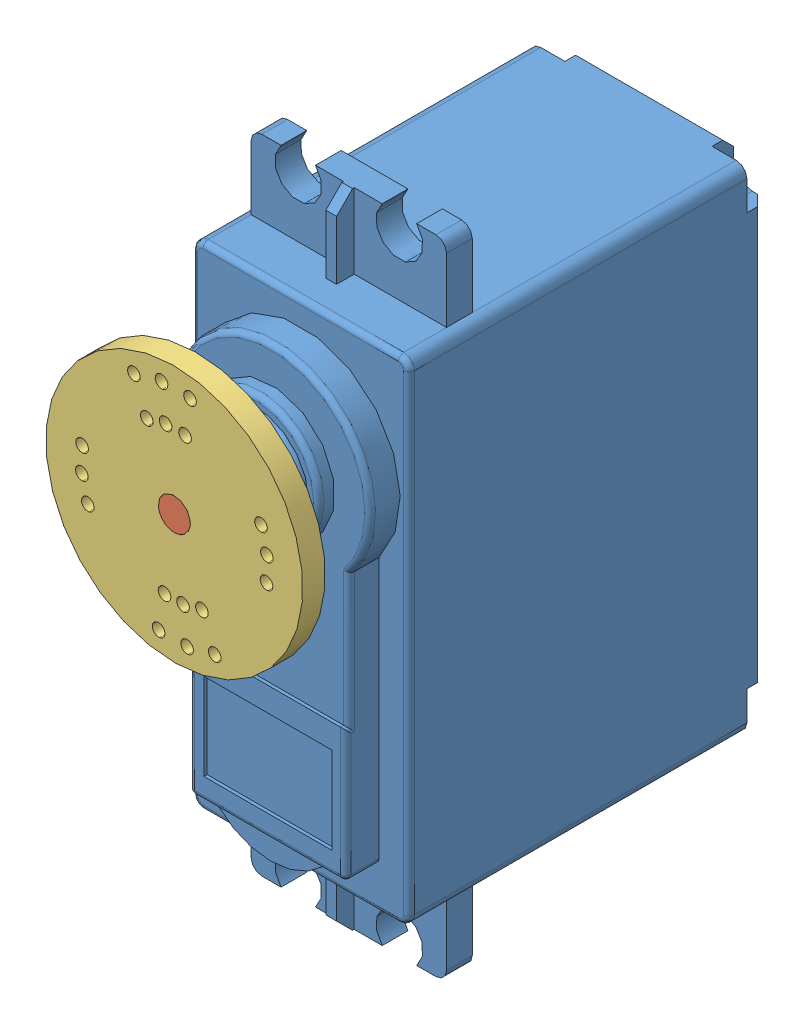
SolidWorks assembly SERVOMOTEUR.SLDASM, configuration Default (file format 3800). Lengths in mm.
Overall size (26.65 60 45.35).
3 component instances, 3 part files, 4 mates.
Components (placement in the parent):
- CORPS SERVOMOT-1: CORPS SERVOMOT.SLDPRT [Default] at (10.0784 1.8594 -6.5815) size (20.25 60 38.35)
- AXE SERVO-1: AXE SERVO.SLDPRT [Default] at (-0.0466 21.8105 26.7685) size (3 3 10)
- VOLANT SERVO-1: VOLANT SERVO.SLDPRT [Default] at (-0.0466 21.8105 36.7685) x (0.993118 0.117118 0) z (0 0 -1) size (24 24 5.6)
Mates (geometry in assembly coordinates):
- Coaxiale1: concentric anti-aligned: cylinder of CORPS SERVOMOT-1; cylinder of AXE SERVO-1
- Distance1: distance = 7 mm aligned: plane of CORPS SERVOMOT-1 through (-0.0466 21.8105 29.7685) normal (0 0 1); plane of AXE SERVO-1 through (-0.0466 21.8105 36.7685) normal (0 0 1)
- Coïncidente3: coincident aligned: plane of AXE SERVO-1 through (-0.0466 21.8105 36.7685) normal (0 0 1); plane of VOLANT SERVO-1 through (-0.0466 21.8105 36.7685) normal (0 0 1)
- Coaxiale2: concentric anti-aligned: cylinder of AXE SERVO-1; circle of VOLANT SERVO-1
